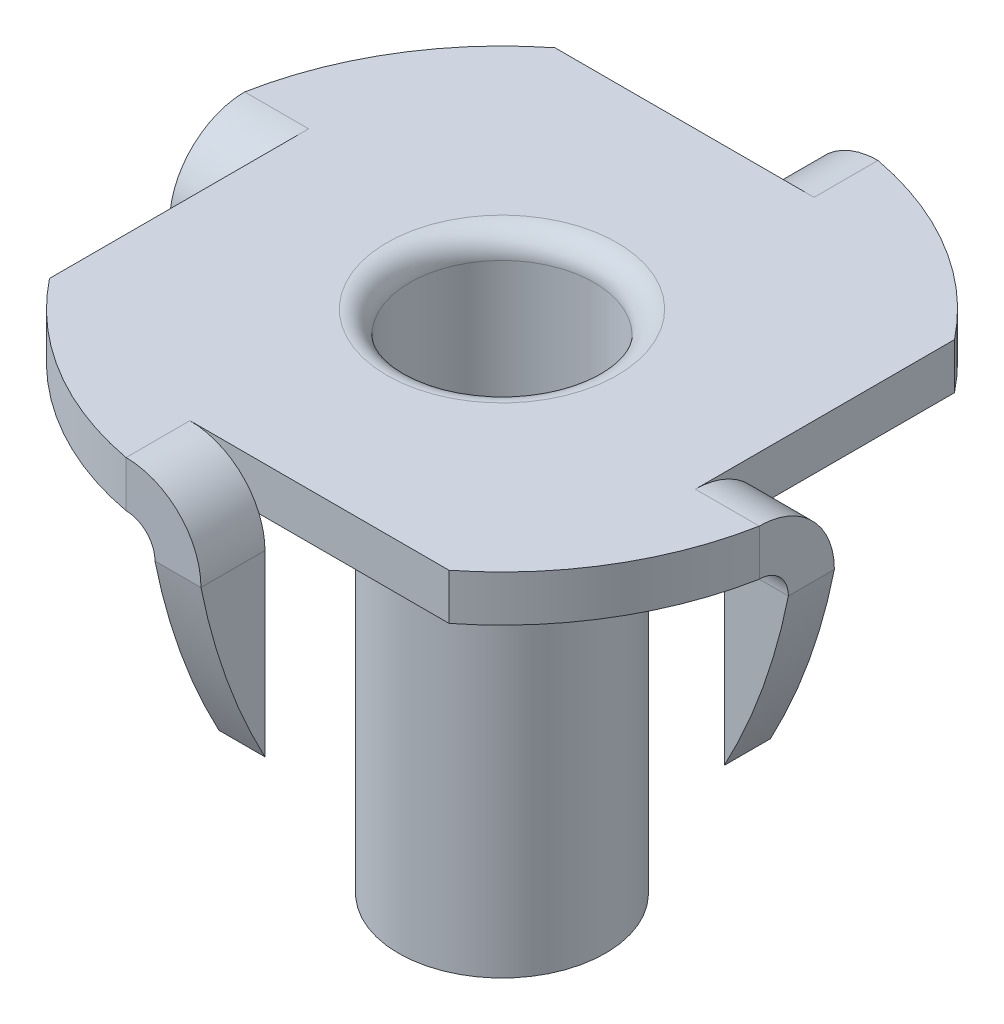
ISO-10303-21;
HEADER;
FILE_DESCRIPTION(('STEP AP214'),'2;1');
FILE_NAME('part.step','',(''),(''),'','','');
FILE_SCHEMA(('AUTOMOTIVE_DESIGN { 1 0 10303 214 1 1 1 1 }'));
ENDSEC;
DATA;
#1=APPLICATION_CONTEXT('core data for automotive mechanical design processes');
#2=APPLICATION_PROTOCOL_DEFINITION('international standard','automotive_design',2000,#1);
#3=PRODUCT_CONTEXT('',#1,'mechanical');
#4=PRODUCT('Part','Part','',(#3));
#5=PRODUCT_RELATED_PRODUCT_CATEGORY('part','',(#4));
#6=PRODUCT_DEFINITION_FORMATION('','',#4);
#7=PRODUCT_DEFINITION_CONTEXT('part definition',#1,'design');
#8=PRODUCT_DEFINITION('design','',#6,#7);
#9=PRODUCT_DEFINITION_SHAPE('','',#8);
#10=(LENGTH_UNIT() NAMED_UNIT(*) SI_UNIT(.MILLI.,.METRE.));
#11=(NAMED_UNIT(*) PLANE_ANGLE_UNIT() SI_UNIT($,.RADIAN.));
#12=(NAMED_UNIT(*) SI_UNIT($,.STERADIAN.) SOLID_ANGLE_UNIT());
#13=UNCERTAINTY_MEASURE_WITH_UNIT(LENGTH_MEASURE(1.E-05),#10,'distance_accuracy_value','');
#14=(GEOMETRIC_REPRESENTATION_CONTEXT(3) GLOBAL_UNCERTAINTY_ASSIGNED_CONTEXT((#13)) GLOBAL_UNIT_ASSIGNED_CONTEXT((#10,
#11,#12)) REPRESENTATION_CONTEXT('',''));
#15=CARTESIAN_POINT('',(0.,0.,0.));
#16=DIRECTION('',(0.,0.,1.));
#17=DIRECTION('',(1.,0.,0.));
#18=AXIS2_PLACEMENT_3D('',#15,#16,#17);
#19=CARTESIAN_POINT('',(8.71808458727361,0.,12.5509212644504));
#20=DIRECTION('',(-1.,0.,0.));
#21=DIRECTION('',(0.,1.,0.));
#22=AXIS2_PLACEMENT_3D('',#19,#20,#21);
#23=PLANE('',#22);
#24=DIRECTION('',(0.,1.,0.));
#25=VECTOR('',#24,1.);
#26=CARTESIAN_POINT('',(8.71808458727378,0.,1.04673390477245));
#27=LINE('',#26,#25);
#28=CARTESIAN_POINT('',(8.71808458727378,-7.1628,1.04673390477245));
#29=VERTEX_POINT('',#28);
#30=CARTESIAN_POINT('',(8.71808458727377,-1.,1.04673390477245));
#31=VERTEX_POINT('',#30);
#32=EDGE_CURVE('E752',#29,#31,#27,.T.);
#33=ORIENTED_EDGE('',*,*,#32,.T.);
#34=DIRECTION('',(0.,0.,-1.));
#35=VECTOR('',#34,1.);
#36=CARTESIAN_POINT('',(8.71808458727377,-1.,1.04673390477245));
#37=LINE('',#36,#35);
#38=CARTESIAN_POINT('',(8.7180845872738,-1.,-0.54076609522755));
#39=VERTEX_POINT('',#38);
#40=EDGE_CURVE('E238',#31,#39,#37,.T.);
#41=ORIENTED_EDGE('',*,*,#40,.T.);
#42=DIRECTION('',(0.,1.,0.));
#43=VECTOR('',#42,1.);
#44=CARTESIAN_POINT('',(8.7180845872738,0.,-0.54076609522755));
#45=LINE('',#44,#43);
#46=CARTESIAN_POINT('',(8.7180845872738,-7.1628,-0.54076609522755));
#47=VERTEX_POINT('',#46);
#48=EDGE_CURVE('E753',#47,#39,#45,.T.);
#49=ORIENTED_EDGE('',*,*,#48,.F.);
#50=DIRECTION('',(0.,0.,-1.));
#51=VECTOR('',#50,1.);
#52=CARTESIAN_POINT('',(8.71808458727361,-7.1628,12.5509212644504));
#53=LINE('',#52,#51);
#54=EDGE_CURVE('E56',#29,#47,#53,.T.);
#55=ORIENTED_EDGE('',*,*,#54,.F.);
#56=EDGE_LOOP('',(#33,#41,#49,#55));
#57=FACE_BOUND('',#56,.T.);
#58=ADVANCED_FACE('F37',(#57),#23,.T.);
#59=CARTESIAN_POINT('',(-10.8750680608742,3.32810054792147,12.5509212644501));
#60=DIRECTION('',(0.,0.,-1.));
#61=DIRECTION('',(0.,1.,0.));
#62=AXIS2_PLACEMENT_3D('',#59,#60,#61);
#63=CYLINDRICAL_SURFACE('',#62,22.225);
#64=CARTESIAN_POINT('',(-10.875068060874,3.32810054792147,-0.540766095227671));
#65=DIRECTION('',(0.,0.,1.));
#66=DIRECTION('',(1.,0.,0.));
#67=AXIS2_PLACEMENT_3D('',#64,#65,#66);
#68=CIRCLE('',#67,22.225);
#69=CARTESIAN_POINT('',(10.9244312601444,-0.999999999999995,-0.540766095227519));
#70=VERTEX_POINT('',#69);
#71=EDGE_CURVE('E740',#70,#47,#68,.F.);
#72=ORIENTED_EDGE('',*,*,#71,.F.);
#73=CARTESIAN_POINT('',(10.9244312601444,-0.999999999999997,1.04673390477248));
#74=CARTESIAN_POINT('',(10.9244312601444,-0.999999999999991,-0.540766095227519));
#75=B_SPLINE_CURVE_WITH_KNOTS('',1,(#73,#74),.UNSPECIFIED.,.F.,.F.,(2,2),(0.,1.),.UNSPECIFIED.);
#76=CARTESIAN_POINT('',(10.9244312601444,-0.999999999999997,1.04673390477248));
#77=VERTEX_POINT('',#76);
#78=EDGE_CURVE('E757',#77,#70,#75,.T.);
#79=ORIENTED_EDGE('',*,*,#78,.F.);
#80=CARTESIAN_POINT('',(-10.875068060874,3.32810054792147,1.04673390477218));
#81=DIRECTION('',(0.,0.,-1.));
#82=DIRECTION('',(0.,1.,0.));
#83=AXIS2_PLACEMENT_3D('',#80,#81,#82);
#84=CIRCLE('',#83,22.225);
#85=EDGE_CURVE('E52',#29,#77,#84,.F.);
#86=ORIENTED_EDGE('',*,*,#85,.F.);
#87=ORIENTED_EDGE('',*,*,#54,.T.);
#88=EDGE_LOOP('',(#72,#79,#86,#87));
#89=FACE_BOUND('',#88,.T.);
#90=ADVANCED_FACE('F725',(#89),#63,.T.);
#91=CARTESIAN_POINT('',(-10.875068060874,3.32810054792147,1.04673390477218));
#92=DIRECTION('',(0.,0.,-1.));
#93=DIRECTION('',(-1.,0.,0.));
#94=AXIS2_PLACEMENT_3D('',#91,#92,#93);
#95=PLANE('',#94);
#96=ORIENTED_EDGE('',*,*,#85,.T.);
#97=DIRECTION('',(1.,0.,0.));
#98=VECTOR('',#97,1.);
#99=CARTESIAN_POINT('',(8.71808458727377,-1.,1.04673390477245));
#100=LINE('',#99,#98);
#101=EDGE_CURVE('E242',#31,#77,#100,.T.);
#102=ORIENTED_EDGE('',*,*,#101,.F.);
#103=ORIENTED_EDGE('',*,*,#32,.F.);
#104=EDGE_LOOP('',(#96,#102,#103));
#105=FACE_BOUND('',#104,.T.);
#106=ADVANCED_FACE('F721',(#105),#95,.F.);
#107=CARTESIAN_POINT('',(11.0993345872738,0.,-0.540766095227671));
#108=DIRECTION('',(0.,0.,1.));
#109=DIRECTION('',(1.,0.,0.));
#110=AXIS2_PLACEMENT_3D('',#107,#108,#109);
#111=PLANE('',#110);
#112=ORIENTED_EDGE('',*,*,#48,.T.);
#113=DIRECTION('',(1.,0.,0.));
#114=VECTOR('',#113,1.);
#115=CARTESIAN_POINT('',(8.71808458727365,-1.,-0.540766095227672));
#116=LINE('',#115,#114);
#117=EDGE_CURVE('E750',#39,#70,#116,.T.);
#118=ORIENTED_EDGE('',*,*,#117,.T.);
#119=ORIENTED_EDGE('',*,*,#71,.T.);
#120=EDGE_LOOP('',(#112,#118,#119));
#121=FACE_BOUND('',#120,.T.);
#122=ADVANCED_FACE('F718',(#121),#111,.F.);
#123=CARTESIAN_POINT('',(8.71808458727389,0.,-6.89076609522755));
#124=DIRECTION('',(-1.,0.,0.));
#125=DIRECTION('',(0.,0.,1.));
#126=AXIS2_PLACEMENT_3D('',#123,#124,#125);
#127=PLANE('',#126);
#128=CARTESIAN_POINT('',(8.71808458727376,-1.,2.04673390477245));
#129=DIRECTION('',(1.,0.,0.));
#130=DIRECTION('',(0.,0.,-1.));
#131=AXIS2_PLACEMENT_3D('',#128,#129,#130);
#132=CIRCLE('',#131,2.5875);
#133=CARTESIAN_POINT('',(8.71808458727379,0.,-0.33971874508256));
#134=VERTEX_POINT('',#133);
#135=CARTESIAN_POINT('',(8.71808458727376,1.5875,2.04673390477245));
#136=VERTEX_POINT('',#135);
#137=EDGE_CURVE('E226',#134,#136,#132,.T.);
#138=ORIENTED_EDGE('',*,*,#137,.F.);
#139=DIRECTION('',(0.,0.,1.));
#140=VECTOR('',#139,1.);
#141=CARTESIAN_POINT('',(8.7180845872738,0.,-0.770882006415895));
#142=LINE('',#141,#140);
#143=CARTESIAN_POINT('',(8.71808458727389,0.,-6.89076609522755));
#144=VERTEX_POINT('',#143);
#145=EDGE_CURVE('E635',#144,#134,#142,.T.);
#146=ORIENTED_EDGE('',*,*,#145,.F.);
#147=DIRECTION('',(0.,1.,0.));
#148=VECTOR('',#147,1.);
#149=CARTESIAN_POINT('',(8.71808458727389,0.,-6.89076609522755));
#150=LINE('',#149,#148);
#151=CARTESIAN_POINT('',(8.71808458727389,1.58750000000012,-6.89076609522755));
#152=VERTEX_POINT('',#151);
#153=EDGE_CURVE('E229',#144,#152,#150,.T.);
#154=ORIENTED_EDGE('',*,*,#153,.T.);
#155=DIRECTION('',(0.,0.,1.));
#156=VECTOR('',#155,1.);
#157=CARTESIAN_POINT('',(8.71808458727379,1.5875,-0.540766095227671));
#158=LINE('',#157,#156);
#159=EDGE_CURVE('E214',#152,#136,#158,.T.);
#160=ORIENTED_EDGE('',*,*,#159,.T.);
#161=EDGE_LOOP('',(#138,#146,#154,#160));
#162=FACE_BOUND('',#161,.T.);
#163=ADVANCED_FACE('F225',(#162),#127,.F.);
#164=CARTESIAN_POINT('',(12.5509212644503,0.,-8.71808458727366));
#165=DIRECTION('',(0.,0.,1.));
#166=DIRECTION('',(0.,1.,0.));
#167=AXIS2_PLACEMENT_3D('',#164,#165,#166);
#168=PLANE('',#167);
#169=DIRECTION('',(0.,1.,0.));
#170=VECTOR('',#169,1.);
#171=CARTESIAN_POINT('',(1.04673390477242,0.,-8.71808458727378));
#172=LINE('',#171,#170);
#173=CARTESIAN_POINT('',(1.04673390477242,-7.1628,-8.71808458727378));
#174=VERTEX_POINT('',#173);
#175=CARTESIAN_POINT('',(1.04673390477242,-1.,-8.71808458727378));
#176=VERTEX_POINT('',#175);
#177=EDGE_CURVE('E677',#174,#176,#172,.T.);
#178=ORIENTED_EDGE('',*,*,#177,.T.);
#179=DIRECTION('',(-1.,0.,0.));
#180=VECTOR('',#179,1.);
#181=CARTESIAN_POINT('',(1.04673390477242,-1.,-8.71808458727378));
#182=LINE('',#181,#180);
#183=CARTESIAN_POINT('',(-0.54076609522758,-1.,-8.7180845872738));
#184=VERTEX_POINT('',#183);
#185=EDGE_CURVE('E669',#176,#184,#182,.T.);
#186=ORIENTED_EDGE('',*,*,#185,.T.);
#187=DIRECTION('',(0.,1.,0.));
#188=VECTOR('',#187,1.);
#189=CARTESIAN_POINT('',(-0.54076609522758,0.,-8.7180845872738));
#190=LINE('',#189,#188);
#191=CARTESIAN_POINT('',(-0.54076609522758,-7.1628,-8.7180845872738));
#192=VERTEX_POINT('',#191);
#193=EDGE_CURVE('E673',#192,#184,#190,.T.);
#194=ORIENTED_EDGE('',*,*,#193,.F.);
#195=DIRECTION('',(-1.,0.,0.));
#196=VECTOR('',#195,1.);
#197=CARTESIAN_POINT('',(12.5509212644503,-7.1628,-8.71808458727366));
#198=LINE('',#197,#196);
#199=EDGE_CURVE('E679',#174,#192,#198,.T.);
#200=ORIENTED_EDGE('',*,*,#199,.F.);
#201=EDGE_LOOP('',(#178,#186,#194,#200));
#202=FACE_BOUND('',#201,.T.);
#203=ADVANCED_FACE('F713',(#202),#168,.T.);
#204=CARTESIAN_POINT('',(12.5509212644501,3.32810054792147,10.8750680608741));
#205=DIRECTION('',(-1.,0.,0.));
#206=DIRECTION('',(0.,-1.,0.));
#207=AXIS2_PLACEMENT_3D('',#204,#205,#206);
#208=CYLINDRICAL_SURFACE('',#207,22.225);
#209=CARTESIAN_POINT('',(-0.540766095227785,3.32810054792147,10.875068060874));
#210=DIRECTION('',(1.,0.,0.));
#211=DIRECTION('',(0.,1.,0.));
#212=AXIS2_PLACEMENT_3D('',#209,#210,#211);
#213=CIRCLE('',#212,22.225);
#214=CARTESIAN_POINT('',(-0.540766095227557,-0.999999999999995,-10.9244312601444));
#215=VERTEX_POINT('',#214);
#216=EDGE_CURVE('E239',#215,#192,#213,.F.);
#217=ORIENTED_EDGE('',*,*,#216,.F.);
#218=CARTESIAN_POINT('',(1.04673390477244,-0.999999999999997,-10.9244312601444));
#219=CARTESIAN_POINT('',(-0.540766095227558,-0.999999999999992,-10.9244312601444));
#220=B_SPLINE_CURVE_WITH_KNOTS('',1,(#218,#219),.UNSPECIFIED.,.F.,.F.,(2,2),(0.,1.),.UNSPECIFIED.);
#221=CARTESIAN_POINT('',(1.04673390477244,-0.999999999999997,-10.9244312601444));
#222=VERTEX_POINT('',#221);
#223=EDGE_CURVE('E676',#222,#215,#220,.T.);
#224=ORIENTED_EDGE('',*,*,#223,.F.);
#225=CARTESIAN_POINT('',(1.04673390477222,3.32810054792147,10.875068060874));
#226=DIRECTION('',(-1.,0.,0.));
#227=DIRECTION('',(0.,-1.,0.));
#228=AXIS2_PLACEMENT_3D('',#225,#226,#227);
#229=CIRCLE('',#228,22.225);
#230=EDGE_CURVE('E245',#174,#222,#229,.F.);
#231=ORIENTED_EDGE('',*,*,#230,.F.);
#232=ORIENTED_EDGE('',*,*,#199,.T.);
#233=EDGE_LOOP('',(#217,#224,#231,#232));
#234=FACE_BOUND('',#233,.T.);
#235=ADVANCED_FACE('F702',(#234),#208,.T.);
#236=CARTESIAN_POINT('',(1.04673390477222,3.32810054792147,10.875068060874));
#237=DIRECTION('',(-1.,0.,0.));
#238=DIRECTION('',(0.,0.,1.));
#239=AXIS2_PLACEMENT_3D('',#236,#237,#238);
#240=PLANE('',#239);
#241=ORIENTED_EDGE('',*,*,#230,.T.);
#242=DIRECTION('',(0.,0.,-1.));
#243=VECTOR('',#242,1.);
#244=CARTESIAN_POINT('',(1.04673390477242,-1.,-8.71808458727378));
#245=LINE('',#244,#243);
#246=EDGE_CURVE('E672',#176,#222,#245,.T.);
#247=ORIENTED_EDGE('',*,*,#246,.F.);
#248=ORIENTED_EDGE('',*,*,#177,.F.);
#249=EDGE_LOOP('',(#241,#247,#248));
#250=FACE_BOUND('',#249,.T.);
#251=ADVANCED_FACE('F712',(#250),#240,.F.);
#252=CARTESIAN_POINT('',(-0.540766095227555,0.,-11.0993345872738));
#253=DIRECTION('',(1.,0.,0.));
#254=DIRECTION('',(0.,0.,-1.));
#255=AXIS2_PLACEMENT_3D('',#252,#253,#254);
#256=PLANE('',#255);
#257=ORIENTED_EDGE('',*,*,#193,.T.);
#258=DIRECTION('',(0.,0.,-1.));
#259=VECTOR('',#258,1.);
#260=CARTESIAN_POINT('',(-0.54076609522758,-1.,-8.71808458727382));
#261=LINE('',#260,#259);
#262=EDGE_CURVE('E675',#184,#215,#261,.T.);
#263=ORIENTED_EDGE('',*,*,#262,.T.);
#264=ORIENTED_EDGE('',*,*,#216,.T.);
#265=EDGE_LOOP('',(#257,#263,#264));
#266=FACE_BOUND('',#265,.T.);
#267=ADVANCED_FACE('F881',(#266),#256,.F.);
#268=CARTESIAN_POINT('',(-6.89076609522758,0.,-8.71808458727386));
#269=DIRECTION('',(0.,0.,1.));
#270=DIRECTION('',(1.,0.,0.));
#271=AXIS2_PLACEMENT_3D('',#268,#269,#270);
#272=PLANE('',#271);
#273=CARTESIAN_POINT('',(2.04673390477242,-1.,-8.71808458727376));
#274=DIRECTION('',(0.,0.,-1.));
#275=DIRECTION('',(-1.,0.,0.));
#276=AXIS2_PLACEMENT_3D('',#273,#274,#275);
#277=CIRCLE('',#276,2.5875);
#278=CARTESIAN_POINT('',(-0.339718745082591,0.,-8.71808458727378));
#279=VERTEX_POINT('',#278);
#280=CARTESIAN_POINT('',(2.04673390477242,1.5875,-8.71808458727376));
#281=VERTEX_POINT('',#280);
#282=EDGE_CURVE('E351',#279,#281,#277,.T.);
#283=ORIENTED_EDGE('',*,*,#282,.F.);
#284=DIRECTION('',(1.,0.,0.));
#285=VECTOR('',#284,1.);
#286=CARTESIAN_POINT('',(-0.770882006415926,0.,-8.7180845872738));
#287=LINE('',#286,#285);
#288=CARTESIAN_POINT('',(-6.89076609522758,0.,-8.71808458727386));
#289=VERTEX_POINT('',#288);
#290=EDGE_CURVE('E638',#289,#279,#287,.T.);
#291=ORIENTED_EDGE('',*,*,#290,.F.);
#292=DIRECTION('',(0.,1.,0.));
#293=VECTOR('',#292,1.);
#294=CARTESIAN_POINT('',(-6.89076609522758,0.,-8.71808458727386));
#295=LINE('',#294,#293);
#296=CARTESIAN_POINT('',(-6.89076609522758,1.5875,-8.71808458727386));
#297=VERTEX_POINT('',#296);
#298=EDGE_CURVE('E434',#289,#297,#295,.T.);
#299=ORIENTED_EDGE('',*,*,#298,.T.);
#300=DIRECTION('',(1.,0.,0.));
#301=VECTOR('',#300,1.);
#302=CARTESIAN_POINT('',(-0.54076609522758,1.5875,-8.7180845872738));
#303=LINE('',#302,#301);
#304=EDGE_CURVE('E645',#297,#281,#303,.T.);
#305=ORIENTED_EDGE('',*,*,#304,.T.);
#306=EDGE_LOOP('',(#283,#291,#299,#305));
#307=FACE_BOUND('',#306,.T.);
#308=ADVANCED_FACE('F407',(#307),#272,.F.);
#309=CARTESIAN_POINT('',(-8.7180845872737,0.,-12.5509212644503));
#310=DIRECTION('',(1.,0.,0.));
#311=DIRECTION('',(0.,1.,0.));
#312=AXIS2_PLACEMENT_3D('',#309,#310,#311);
#313=PLANE('',#312);
#314=DIRECTION('',(0.,1.,0.));
#315=VECTOR('',#314,1.);
#316=CARTESIAN_POINT('',(-8.71808458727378,0.,-1.04673390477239));
#317=LINE('',#316,#315);
#318=CARTESIAN_POINT('',(-8.71808458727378,-7.1628,-1.04673390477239));
#319=VERTEX_POINT('',#318);
#320=CARTESIAN_POINT('',(-8.71808458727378,-1.,-1.04673390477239));
#321=VERTEX_POINT('',#320);
#322=EDGE_CURVE('E981',#319,#321,#317,.T.);
#323=ORIENTED_EDGE('',*,*,#322,.T.);
#324=DIRECTION('',(0.,0.,1.));
#325=VECTOR('',#324,1.);
#326=CARTESIAN_POINT('',(-8.71808458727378,-1.,-1.04673390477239));
#327=LINE('',#326,#325);
#328=CARTESIAN_POINT('',(-8.7180845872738,-1.,0.54076609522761));
#329=VERTEX_POINT('',#328);
#330=EDGE_CURVE('E859',#321,#329,#327,.T.);
#331=ORIENTED_EDGE('',*,*,#330,.T.);
#332=DIRECTION('',(0.,1.,0.));
#333=VECTOR('',#332,1.);
#334=CARTESIAN_POINT('',(-8.7180845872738,0.,0.54076609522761));
#335=LINE('',#334,#333);
#336=CARTESIAN_POINT('',(-8.71808458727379,-7.1628,0.54076609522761));
#337=VERTEX_POINT('',#336);
#338=EDGE_CURVE('E973',#337,#329,#335,.T.);
#339=ORIENTED_EDGE('',*,*,#338,.F.);
#340=DIRECTION('',(0.,0.,1.));
#341=VECTOR('',#340,1.);
#342=CARTESIAN_POINT('',(-8.7180845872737,-7.1628,-12.5509212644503));
#343=LINE('',#342,#341);
#344=EDGE_CURVE('E852',#319,#337,#343,.T.);
#345=ORIENTED_EDGE('',*,*,#344,.F.);
#346=EDGE_LOOP('',(#323,#331,#339,#345));
#347=FACE_BOUND('',#346,.T.);
#348=ADVANCED_FACE('F876',(#347),#313,.T.);
#349=CARTESIAN_POINT('',(10.8750680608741,3.32810054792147,-12.5509212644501));
#350=DIRECTION('',(0.,0.,1.));
#351=DIRECTION('',(0.,-1.,0.));
#352=AXIS2_PLACEMENT_3D('',#349,#350,#351);
#353=CYLINDRICAL_SURFACE('',#352,22.225);
#354=CARTESIAN_POINT('',(10.875068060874,3.32810054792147,0.540766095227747));
#355=DIRECTION('',(0.,0.,-1.));
#356=DIRECTION('',(0.,1.,0.));
#357=AXIS2_PLACEMENT_3D('',#354,#355,#356);
#358=CIRCLE('',#357,22.225);
#359=CARTESIAN_POINT('',(-10.9244312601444,-0.999999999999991,0.540766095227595));
#360=VERTEX_POINT('',#359);
#361=EDGE_CURVE('E851',#360,#337,#358,.F.);
#362=ORIENTED_EDGE('',*,*,#361,.F.);
#363=CARTESIAN_POINT('',(-10.9244312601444,-0.999999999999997,-1.0467339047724));
#364=CARTESIAN_POINT('',(-10.9244312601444,-0.999999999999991,0.540766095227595));
#365=B_SPLINE_CURVE_WITH_KNOTS('',1,(#363,#364),.UNSPECIFIED.,.F.,.F.,(2,2),(0.,1.),.UNSPECIFIED.);
#366=CARTESIAN_POINT('',(-10.9244312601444,-1.,-1.04673390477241));
#367=VERTEX_POINT('',#366);
#368=EDGE_CURVE('E858',#367,#360,#365,.T.);
#369=ORIENTED_EDGE('',*,*,#368,.F.);
#370=CARTESIAN_POINT('',(10.875068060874,3.32810054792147,-1.04673390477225));
#371=DIRECTION('',(0.,0.,1.));
#372=DIRECTION('',(0.,-1.,0.));
#373=AXIS2_PLACEMENT_3D('',#370,#371,#372);
#374=CIRCLE('',#373,22.225);
#375=EDGE_CURVE('E848',#319,#367,#374,.F.);
#376=ORIENTED_EDGE('',*,*,#375,.F.);
#377=ORIENTED_EDGE('',*,*,#344,.T.);
#378=EDGE_LOOP('',(#362,#369,#376,#377));
#379=FACE_BOUND('',#378,.T.);
#380=ADVANCED_FACE('F865',(#379),#353,.T.);
#381=CARTESIAN_POINT('',(10.875068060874,3.32810054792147,-1.04673390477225));
#382=DIRECTION('',(0.,0.,1.));
#383=DIRECTION('',(1.,0.,0.));
#384=AXIS2_PLACEMENT_3D('',#381,#382,#383);
#385=PLANE('',#384);
#386=ORIENTED_EDGE('',*,*,#375,.T.);
#387=DIRECTION('',(-1.,0.,0.));
#388=VECTOR('',#387,1.);
#389=CARTESIAN_POINT('',(-8.71808458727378,-1.,-1.04673390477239));
#390=LINE('',#389,#388);
#391=EDGE_CURVE('E855',#321,#367,#390,.T.);
#392=ORIENTED_EDGE('',*,*,#391,.F.);
#393=ORIENTED_EDGE('',*,*,#322,.F.);
#394=EDGE_LOOP('',(#386,#392,#393));
#395=FACE_BOUND('',#394,.T.);
#396=ADVANCED_FACE('F875',(#395),#385,.F.);
#397=CARTESIAN_POINT('',(-11.0993345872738,0.,0.540766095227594));
#398=DIRECTION('',(0.,0.,-1.));
#399=DIRECTION('',(-1.,0.,0.));
#400=AXIS2_PLACEMENT_3D('',#397,#398,#399);
#401=PLANE('',#400);
#402=ORIENTED_EDGE('',*,*,#338,.T.);
#403=DIRECTION('',(-1.,0.,0.));
#404=VECTOR('',#403,1.);
#405=CARTESIAN_POINT('',(-8.71808458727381,-1.,0.540766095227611));
#406=LINE('',#405,#404);
#407=EDGE_CURVE('E976',#329,#360,#406,.T.);
#408=ORIENTED_EDGE('',*,*,#407,.T.);
#409=ORIENTED_EDGE('',*,*,#361,.T.);
#410=EDGE_LOOP('',(#402,#408,#409));
#411=FACE_BOUND('',#410,.T.);
#412=ADVANCED_FACE('F961',(#411),#401,.F.);
#413=CARTESIAN_POINT('',(-8.71808458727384,0.,6.89076609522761));
#414=DIRECTION('',(1.,0.,0.));
#415=DIRECTION('',(0.,0.,-1.));
#416=AXIS2_PLACEMENT_3D('',#413,#414,#415);
#417=PLANE('',#416);
#418=CARTESIAN_POINT('',(-8.71808458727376,-1.,-2.04673390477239));
#419=DIRECTION('',(-1.,0.,0.));
#420=DIRECTION('',(0.,0.,1.));
#421=AXIS2_PLACEMENT_3D('',#418,#419,#420);
#422=CIRCLE('',#421,2.5875);
#423=CARTESIAN_POINT('',(-8.71808458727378,0.,0.33971874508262));
#424=VERTEX_POINT('',#423);
#425=CARTESIAN_POINT('',(-8.71808458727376,1.5875,-2.04673390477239));
#426=VERTEX_POINT('',#425);
#427=EDGE_CURVE('E447',#424,#426,#422,.T.);
#428=ORIENTED_EDGE('',*,*,#427,.F.);
#429=DIRECTION('',(0.,0.,-1.));
#430=VECTOR('',#429,1.);
#431=CARTESIAN_POINT('',(-8.7180845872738,0.,0.770882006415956));
#432=LINE('',#431,#430);
#433=CARTESIAN_POINT('',(-8.71808458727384,0.,6.89076609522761));
#434=VERTEX_POINT('',#433);
#435=EDGE_CURVE('E642',#434,#424,#432,.T.);
#436=ORIENTED_EDGE('',*,*,#435,.F.);
#437=DIRECTION('',(0.,1.,0.));
#438=VECTOR('',#437,1.);
#439=CARTESIAN_POINT('',(-8.71808458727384,0.,6.89076609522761));
#440=LINE('',#439,#438);
#441=CARTESIAN_POINT('',(-8.71808458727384,1.5875,6.89076609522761));
#442=VERTEX_POINT('',#441);
#443=EDGE_CURVE('E530',#434,#442,#440,.T.);
#444=ORIENTED_EDGE('',*,*,#443,.T.);
#445=DIRECTION('',(0.,0.,-1.));
#446=VECTOR('',#445,1.);
#447=CARTESIAN_POINT('',(-8.71808458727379,1.5875,0.54076609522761));
#448=LINE('',#447,#446);
#449=EDGE_CURVE('E651',#442,#426,#448,.T.);
#450=ORIENTED_EDGE('',*,*,#449,.T.);
#451=EDGE_LOOP('',(#428,#436,#444,#450));
#452=FACE_BOUND('',#451,.T.);
#453=ADVANCED_FACE('F503',(#452),#417,.F.);
#454=CARTESIAN_POINT('',(-12.5509212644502,0.,8.71808458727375));
#455=DIRECTION('',(0.,0.,-1.));
#456=DIRECTION('',(0.,1.,0.));
#457=AXIS2_PLACEMENT_3D('',#454,#455,#456);
#458=PLANE('',#457);
#459=DIRECTION('',(0.,1.,0.));
#460=VECTOR('',#459,1.);
#461=CARTESIAN_POINT('',(-1.04673390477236,0.,8.71808458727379));
#462=LINE('',#461,#460);
#463=CARTESIAN_POINT('',(-1.04673390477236,-7.1628,8.71808458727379));
#464=VERTEX_POINT('',#463);
#465=CARTESIAN_POINT('',(-1.04673390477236,-1.,8.71808458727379));
#466=VERTEX_POINT('',#465);
#467=EDGE_CURVE('E1010',#464,#466,#462,.T.);
#468=ORIENTED_EDGE('',*,*,#467,.T.);
#469=DIRECTION('',(1.,0.,0.));
#470=VECTOR('',#469,1.);
#471=CARTESIAN_POINT('',(-1.04673390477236,-1.,8.71808458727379));
#472=LINE('',#471,#470);
#473=CARTESIAN_POINT('',(0.540766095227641,-1.,8.71808458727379));
#474=VERTEX_POINT('',#473);
#475=EDGE_CURVE('E941',#466,#474,#472,.T.);
#476=ORIENTED_EDGE('',*,*,#475,.T.);
#477=DIRECTION('',(0.,1.,0.));
#478=VECTOR('',#477,1.);
#479=CARTESIAN_POINT('',(0.540766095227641,-0.769884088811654,8.71808458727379));
#480=LINE('',#479,#478);
#481=CARTESIAN_POINT('',(0.540766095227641,-7.1628,8.71808458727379));
#482=VERTEX_POINT('',#481);
#483=EDGE_CURVE('E996',#482,#474,#480,.T.);
#484=ORIENTED_EDGE('',*,*,#483,.F.);
#485=DIRECTION('',(1.,0.,0.));
#486=VECTOR('',#485,1.);
#487=CARTESIAN_POINT('',(-12.5509212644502,-7.1628,8.71808458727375));
#488=LINE('',#487,#486);
#489=EDGE_CURVE('E934',#464,#482,#488,.T.);
#490=ORIENTED_EDGE('',*,*,#489,.F.);
#491=EDGE_LOOP('',(#468,#476,#484,#490));
#492=FACE_BOUND('',#491,.T.);
#493=ADVANCED_FACE('F957',(#492),#458,.T.);
#494=CARTESIAN_POINT('',(-12.5509212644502,3.32810054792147,-10.8750680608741));
#495=DIRECTION('',(1.,0.,0.));
#496=DIRECTION('',(0.,1.,0.));
#497=AXIS2_PLACEMENT_3D('',#494,#495,#496);
#498=CYLINDRICAL_SURFACE('',#497,22.225);
#499=CARTESIAN_POINT('',(0.540766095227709,3.32810054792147,-10.875068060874));
#500=DIRECTION('',(-1.,0.,0.));
#501=DIRECTION('',(0.,-1.,0.));
#502=AXIS2_PLACEMENT_3D('',#499,#500,#501);
#503=CIRCLE('',#502,22.225);
#504=CARTESIAN_POINT('',(0.540766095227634,-0.999999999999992,10.9244312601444));
#505=VERTEX_POINT('',#504);
#506=EDGE_CURVE('E933',#505,#482,#503,.F.);
#507=ORIENTED_EDGE('',*,*,#506,.F.);
#508=CARTESIAN_POINT('',(-1.04673390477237,-0.999999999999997,10.9244312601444));
#509=CARTESIAN_POINT('',(0.540766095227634,-0.999999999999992,10.9244312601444));
#510=B_SPLINE_CURVE_WITH_KNOTS('',1,(#508,#509),.UNSPECIFIED.,.F.,.F.,(2,2),(0.,1.),.UNSPECIFIED.);
#511=CARTESIAN_POINT('',(-1.04673390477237,-1.,10.9244312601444));
#512=VERTEX_POINT('',#511);
#513=EDGE_CURVE('E940',#512,#505,#510,.T.);
#514=ORIENTED_EDGE('',*,*,#513,.F.);
#515=CARTESIAN_POINT('',(-1.04673390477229,3.32810054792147,-10.875068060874));
#516=DIRECTION('',(1.,0.,0.));
#517=DIRECTION('',(0.,1.,0.));
#518=AXIS2_PLACEMENT_3D('',#515,#516,#517);
#519=CIRCLE('',#518,22.225);
#520=EDGE_CURVE('E930',#464,#512,#519,.F.);
#521=ORIENTED_EDGE('',*,*,#520,.F.);
#522=ORIENTED_EDGE('',*,*,#489,.T.);
#523=EDGE_LOOP('',(#507,#514,#521,#522));
#524=FACE_BOUND('',#523,.T.);
#525=ADVANCED_FACE('F947',(#524),#498,.T.);
#526=CARTESIAN_POINT('',(-1.04673390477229,3.32810054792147,-10.875068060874));
#527=DIRECTION('',(1.,0.,0.));
#528=DIRECTION('',(0.,0.,-1.));
#529=AXIS2_PLACEMENT_3D('',#526,#527,#528);
#530=PLANE('',#529);
#531=ORIENTED_EDGE('',*,*,#520,.T.);
#532=DIRECTION('',(0.,0.,1.));
#533=VECTOR('',#532,1.);
#534=CARTESIAN_POINT('',(-1.04673390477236,-1.,8.71808458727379));
#535=LINE('',#534,#533);
#536=EDGE_CURVE('E937',#466,#512,#535,.T.);
#537=ORIENTED_EDGE('',*,*,#536,.F.);
#538=ORIENTED_EDGE('',*,*,#467,.F.);
#539=EDGE_LOOP('',(#531,#537,#538));
#540=FACE_BOUND('',#539,.T.);
#541=ADVANCED_FACE('F956',(#540),#530,.F.);
#542=CARTESIAN_POINT('',(0.540766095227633,0.,11.0993345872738));
#543=DIRECTION('',(-1.,0.,0.));
#544=DIRECTION('',(0.,0.,1.));
#545=AXIS2_PLACEMENT_3D('',#542,#543,#544);
#546=PLANE('',#545);
#547=ORIENTED_EDGE('',*,*,#506,.T.);
#548=ORIENTED_EDGE('',*,*,#483,.T.);
#549=DIRECTION('',(0.,0.,1.));
#550=VECTOR('',#549,1.);
#551=CARTESIAN_POINT('',(0.540766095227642,-1.,8.7180845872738));
#552=LINE('',#551,#550);
#553=EDGE_CURVE('E1009',#474,#505,#552,.T.);
#554=ORIENTED_EDGE('',*,*,#553,.T.);
#555=EDGE_LOOP('',(#547,#548,#554));
#556=FACE_BOUND('',#555,.T.);
#557=ADVANCED_FACE('F784',(#556),#546,.F.);
#558=CARTESIAN_POINT('',(6.89076609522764,0.,8.71808458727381));
#559=DIRECTION('',(0.,0.,-1.));
#560=DIRECTION('',(-1.,0.,0.));
#561=AXIS2_PLACEMENT_3D('',#558,#559,#560);
#562=PLANE('',#561);
#563=CARTESIAN_POINT('',(-2.04673390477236,-1.,8.71808458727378));
#564=DIRECTION('',(0.,0.,1.));
#565=DIRECTION('',(1.,0.,0.));
#566=AXIS2_PLACEMENT_3D('',#563,#564,#565);
#567=CIRCLE('',#566,2.5875);
#568=CARTESIAN_POINT('',(0.339718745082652,0.,8.71808458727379));
#569=VERTEX_POINT('',#568);
#570=CARTESIAN_POINT('',(-2.04673390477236,1.5875,8.71808458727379));
#571=VERTEX_POINT('',#570);
#572=EDGE_CURVE('E543',#569,#571,#567,.T.);
#573=ORIENTED_EDGE('',*,*,#572,.F.);
#574=DIRECTION('',(1.,0.,0.));
#575=VECTOR('',#574,1.);
#576=CARTESIAN_POINT('',(-1.04673390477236,0.,8.71808458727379));
#577=LINE('',#576,#575);
#578=CARTESIAN_POINT('',(6.89076609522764,0.,8.71808458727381));
#579=VERTEX_POINT('',#578);
#580=EDGE_CURVE('E904',#569,#579,#577,.T.);
#581=ORIENTED_EDGE('',*,*,#580,.T.);
#582=DIRECTION('',(0.,1.,0.));
#583=VECTOR('',#582,1.);
#584=CARTESIAN_POINT('',(6.89076609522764,0.,8.71808458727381));
#585=LINE('',#584,#583);
#586=CARTESIAN_POINT('',(6.89076609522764,1.5875,8.71808458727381));
#587=VERTEX_POINT('',#586);
#588=EDGE_CURVE('E626',#579,#587,#585,.T.);
#589=ORIENTED_EDGE('',*,*,#588,.T.);
#590=DIRECTION('',(-1.,0.,0.));
#591=VECTOR('',#590,1.);
#592=CARTESIAN_POINT('',(-1.04673390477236,1.5875,8.71808458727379));
#593=LINE('',#592,#591);
#594=EDGE_CURVE('E222',#587,#571,#593,.T.);
#595=ORIENTED_EDGE('',*,*,#594,.T.);
#596=EDGE_LOOP('',(#573,#581,#589,#595));
#597=FACE_BOUND('',#596,.T.);
#598=ADVANCED_FACE('F599',(#597),#562,.F.);
#599=CARTESIAN_POINT('',(0.,-60.1988510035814,0.));
#600=DIRECTION('',(0.,1.,0.));
#601=DIRECTION('',(0.,0.,1.));
#602=AXIS2_PLACEMENT_3D('',#599,#600,#601);
#603=CYLINDRICAL_SURFACE('',#602,11.1125);
#604=CARTESIAN_POINT('',(10.9223869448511,1.5875,2.04673390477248));
#605=CARTESIAN_POINT('',(10.9223869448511,0.,2.04673390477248));
#606=B_SPLINE_CURVE_WITH_KNOTS('',1,(#604,#605),.UNSPECIFIED.,.F.,.F.,(2,2),(0.,1.),.UNSPECIFIED.);
#607=CARTESIAN_POINT('',(10.9223869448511,0.,2.04673390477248));
#608=VERTEX_POINT('',#607);
#609=CARTESIAN_POINT('',(10.9223869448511,1.5875,2.04673390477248));
#610=VERTEX_POINT('',#609);
#611=EDGE_CURVE('E335',#608,#610,#606,.F.);
#612=ORIENTED_EDGE('',*,*,#611,.T.);
#613=CARTESIAN_POINT('',(0.,1.5875,0.));
#614=DIRECTION('',(0.,1.,0.));
#615=DIRECTION('',(0.,0.,1.));
#616=AXIS2_PLACEMENT_3D('',#613,#614,#615);
#617=CIRCLE('',#616,11.1125);
#618=EDGE_CURVE('E216',#587,#610,#617,.T.);
#619=ORIENTED_EDGE('',*,*,#618,.F.);
#620=ORIENTED_EDGE('',*,*,#588,.F.);
#621=CARTESIAN_POINT('',(0.,0.,0.));
#622=DIRECTION('',(0.,1.,0.));
#623=DIRECTION('',(0.,0.,1.));
#624=AXIS2_PLACEMENT_3D('',#621,#622,#623);
#625=CIRCLE('',#624,11.1125);
#626=EDGE_CURVE('E221',#579,#608,#625,.T.);
#627=ORIENTED_EDGE('',*,*,#626,.T.);
#628=EDGE_LOOP('',(#612,#619,#620,#627));
#629=FACE_BOUND('',#628,.T.);
#630=ADVANCED_FACE('F770',(#629),#603,.T.);
#631=CARTESIAN_POINT('',(-2.04673390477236,1.5875,10.9223869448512));
#632=CARTESIAN_POINT('',(-2.04673390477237,0.,10.9223869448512));
#633=B_SPLINE_CURVE_WITH_KNOTS('',1,(#631,#632),.UNSPECIFIED.,.F.,.F.,(2,2),(0.,1.),.UNSPECIFIED.);
#634=CARTESIAN_POINT('',(-2.04673390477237,0.,10.9223869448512));
#635=VERTEX_POINT('',#634);
#636=CARTESIAN_POINT('',(-2.04673390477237,1.5875,10.9223869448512));
#637=VERTEX_POINT('',#636);
#638=EDGE_CURVE('E622',#635,#637,#633,.F.);
#639=ORIENTED_EDGE('',*,*,#638,.T.);
#640=EDGE_CURVE('E655',#442,#637,#617,.T.);
#641=ORIENTED_EDGE('',*,*,#640,.F.);
#642=ORIENTED_EDGE('',*,*,#443,.F.);
#643=EDGE_CURVE('E833',#434,#635,#625,.T.);
#644=ORIENTED_EDGE('',*,*,#643,.T.);
#645=EDGE_LOOP('',(#639,#641,#642,#644));
#646=FACE_BOUND('',#645,.T.);
#647=ADVANCED_FACE('F780',(#646),#603,.T.);
#648=CARTESIAN_POINT('',(-10.9223869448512,1.5875,-2.0467339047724));
#649=CARTESIAN_POINT('',(-10.9223869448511,0.,-2.0467339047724));
#650=B_SPLINE_CURVE_WITH_KNOTS('',1,(#648,#649),.UNSPECIFIED.,.F.,.F.,(2,2),(0.,1.),.UNSPECIFIED.);
#651=CARTESIAN_POINT('',(-10.9223869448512,0.,-2.0467339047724));
#652=VERTEX_POINT('',#651);
#653=CARTESIAN_POINT('',(-10.9223869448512,1.5875,-2.0467339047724));
#654=VERTEX_POINT('',#653);
#655=EDGE_CURVE('E526',#652,#654,#650,.F.);
#656=ORIENTED_EDGE('',*,*,#655,.T.);
#657=EDGE_CURVE('E648',#297,#654,#617,.T.);
#658=ORIENTED_EDGE('',*,*,#657,.F.);
#659=ORIENTED_EDGE('',*,*,#298,.F.);
#660=EDGE_CURVE('E837',#289,#652,#625,.T.);
#661=ORIENTED_EDGE('',*,*,#660,.T.);
#662=EDGE_LOOP('',(#656,#658,#659,#661));
#663=FACE_BOUND('',#662,.T.);
#664=ADVANCED_FACE('F918',(#663),#603,.T.);
#665=CARTESIAN_POINT('',(2.04673390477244,1.5875,-10.9223869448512));
#666=CARTESIAN_POINT('',(2.04673390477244,0.,-10.9223869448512));
#667=B_SPLINE_CURVE_WITH_KNOTS('',1,(#665,#666),.UNSPECIFIED.,.F.,.F.,(2,2),(0.,1.),.UNSPECIFIED.);
#668=CARTESIAN_POINT('',(2.04673390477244,0.,-10.9223869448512));
#669=VERTEX_POINT('',#668);
#670=CARTESIAN_POINT('',(2.04673390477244,1.5875,-10.9223869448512));
#671=VERTEX_POINT('',#670);
#672=EDGE_CURVE('E430',#669,#671,#667,.F.);
#673=ORIENTED_EDGE('',*,*,#672,.T.);
#674=EDGE_CURVE('E231',#152,#671,#617,.T.);
#675=ORIENTED_EDGE('',*,*,#674,.F.);
#676=ORIENTED_EDGE('',*,*,#153,.F.);
#677=EDGE_CURVE('E839',#144,#669,#625,.T.);
#678=ORIENTED_EDGE('',*,*,#677,.T.);
#679=EDGE_LOOP('',(#673,#675,#676,#678));
#680=FACE_BOUND('',#679,.T.);
#681=ADVANCED_FACE('F782',(#680),#603,.T.);
#682=CARTESIAN_POINT('',(0.,0.,0.));
#683=DIRECTION('',(0.,1.,0.));
#684=DIRECTION('',(0.,0.,1.));
#685=AXIS2_PLACEMENT_3D('',#682,#683,#684);
#686=PLANE('',#685);
#687=CARTESIAN_POINT('',(0.,0.,0.));
#688=DIRECTION('',(0.,1.,0.));
#689=DIRECTION('',(0.,0.,1.));
#690=AXIS2_PLACEMENT_3D('',#687,#688,#689);
#691=CIRCLE('',#690,3.571875);
#692=CARTESIAN_POINT('',(0.,0.,3.571875));
#693=VERTEX_POINT('',#692);
#694=EDGE_CURVE('E1344',#693,#693,#691,.T.);
#695=ORIENTED_EDGE('',*,*,#694,.T.);
#696=EDGE_LOOP('',(#695));
#697=FACE_BOUND('',#696,.T.);
#698=ORIENTED_EDGE('',*,*,#145,.T.);
#699=CARTESIAN_POINT('',(8.71808458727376,0.,2.04673390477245));
#700=VERTEX_POINT('',#699);
#701=EDGE_CURVE('E634',#134,#700,#142,.T.);
#702=ORIENTED_EDGE('',*,*,#701,.T.);
#703=DIRECTION('',(1.,0.,0.));
#704=VECTOR('',#703,1.);
#705=CARTESIAN_POINT('',(8.71808458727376,0.,2.04673390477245));
#706=LINE('',#705,#704);
#707=EDGE_CURVE('E251',#700,#608,#706,.T.);
#708=ORIENTED_EDGE('',*,*,#707,.T.);
#709=ORIENTED_EDGE('',*,*,#626,.F.);
#710=ORIENTED_EDGE('',*,*,#580,.F.);
#711=CARTESIAN_POINT('',(-2.04673390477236,0.,8.71808458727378));
#712=VERTEX_POINT('',#711);
#713=EDGE_CURVE('E828',#712,#569,#577,.T.);
#714=ORIENTED_EDGE('',*,*,#713,.F.);
#715=DIRECTION('',(0.,0.,1.));
#716=VECTOR('',#715,1.);
#717=CARTESIAN_POINT('',(-2.04673390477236,0.,8.71808458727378));
#718=LINE('',#717,#716);
#719=EDGE_CURVE('E1012',#712,#635,#718,.T.);
#720=ORIENTED_EDGE('',*,*,#719,.T.);
#721=ORIENTED_EDGE('',*,*,#643,.F.);
#722=ORIENTED_EDGE('',*,*,#435,.T.);
#723=CARTESIAN_POINT('',(-8.71808458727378,0.,-2.04673390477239));
#724=VERTEX_POINT('',#723);
#725=EDGE_CURVE('E641',#424,#724,#432,.T.);
#726=ORIENTED_EDGE('',*,*,#725,.T.);
#727=DIRECTION('',(-1.,0.,0.));
#728=VECTOR('',#727,1.);
#729=CARTESIAN_POINT('',(-8.71808458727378,0.,-2.04673390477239));
#730=LINE('',#729,#728);
#731=EDGE_CURVE('E922',#724,#652,#730,.T.);
#732=ORIENTED_EDGE('',*,*,#731,.T.);
#733=ORIENTED_EDGE('',*,*,#660,.F.);
#734=ORIENTED_EDGE('',*,*,#290,.T.);
#735=CARTESIAN_POINT('',(2.04673390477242,0.,-8.71808458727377));
#736=VERTEX_POINT('',#735);
#737=EDGE_CURVE('E637',#279,#736,#287,.T.);
#738=ORIENTED_EDGE('',*,*,#737,.T.);
#739=DIRECTION('',(0.,0.,-1.));
#740=VECTOR('',#739,1.);
#741=CARTESIAN_POINT('',(2.04673390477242,0.,-8.71808458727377));
#742=LINE('',#741,#740);
#743=EDGE_CURVE('E844',#736,#669,#742,.T.);
#744=ORIENTED_EDGE('',*,*,#743,.T.);
#745=ORIENTED_EDGE('',*,*,#677,.F.);
#746=EDGE_LOOP('',(#698,#702,#708,#709,#710,#714,#720,#721,#722,#726,#732,#733,#734,#738,#744,#745));
#747=FACE_BOUND('',#746,.T.);
#748=ADVANCED_FACE('F783',(#697,#747),#686,.F.);
#749=CARTESIAN_POINT('',(0.,1.5875,0.));
#750=DIRECTION('',(0.,1.,0.));
#751=DIRECTION('',(0.,0.,1.));
#752=AXIS2_PLACEMENT_3D('',#749,#750,#751);
#753=PLANE('',#752);
#754=CARTESIAN_POINT('',(0.,1.5875,0.));
#755=DIRECTION('',(0.,1.,0.));
#756=DIRECTION('',(0.,0.,1.));
#757=AXIS2_PLACEMENT_3D('',#754,#755,#756);
#758=CIRCLE('',#757,3.96875);
#759=CARTESIAN_POINT('',(0.,1.5875,3.96875));
#760=VERTEX_POINT('',#759);
#761=EDGE_CURVE('E11',#760,#760,#758,.F.);
#762=ORIENTED_EDGE('',*,*,#761,.T.);
#763=EDGE_LOOP('',(#762));
#764=FACE_BOUND('',#763,.T.);
#765=DIRECTION('',(-1.,0.,0.));
#766=VECTOR('',#765,1.);
#767=CARTESIAN_POINT('',(8.71808458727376,1.5875,2.04673390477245));
#768=LINE('',#767,#766);
#769=EDGE_CURVE('E210',#610,#136,#768,.T.);
#770=ORIENTED_EDGE('',*,*,#769,.T.);
#771=ORIENTED_EDGE('',*,*,#159,.F.);
#772=ORIENTED_EDGE('',*,*,#674,.T.);
#773=DIRECTION('',(0.,0.,1.));
#774=VECTOR('',#773,1.);
#775=CARTESIAN_POINT('',(2.04673390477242,1.5875,-8.71808458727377));
#776=LINE('',#775,#774);
#777=EDGE_CURVE('E666',#671,#281,#776,.T.);
#778=ORIENTED_EDGE('',*,*,#777,.T.);
#779=ORIENTED_EDGE('',*,*,#304,.F.);
#780=ORIENTED_EDGE('',*,*,#657,.T.);
#781=DIRECTION('',(1.,0.,0.));
#782=VECTOR('',#781,1.);
#783=CARTESIAN_POINT('',(-8.71808458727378,1.5875,-2.04673390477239));
#784=LINE('',#783,#782);
#785=EDGE_CURVE('E809',#654,#426,#784,.T.);
#786=ORIENTED_EDGE('',*,*,#785,.T.);
#787=ORIENTED_EDGE('',*,*,#449,.F.);
#788=ORIENTED_EDGE('',*,*,#640,.T.);
#789=DIRECTION('',(0.,0.,-1.));
#790=VECTOR('',#789,1.);
#791=CARTESIAN_POINT('',(-2.04673390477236,1.5875,8.71808458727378));
#792=LINE('',#791,#790);
#793=EDGE_CURVE('E812',#637,#571,#792,.T.);
#794=ORIENTED_EDGE('',*,*,#793,.T.);
#795=ORIENTED_EDGE('',*,*,#594,.F.);
#796=ORIENTED_EDGE('',*,*,#618,.T.);
#797=EDGE_LOOP('',(#770,#771,#772,#778,#779,#780,#786,#787,#788,#794,#795,#796));
#798=FACE_BOUND('',#797,.T.);
#799=ADVANCED_FACE('F212',(#764,#798),#753,.T.);
#800=CARTESIAN_POINT('',(-2.04673390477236,1.5875,10.9223869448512));
#801=CARTESIAN_POINT('',(-1.70796987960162,1.5875,10.9225573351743));
#802=CARTESIAN_POINT('',(-1.36946125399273,1.52015430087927,10.9227276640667));
#803=CARTESIAN_POINT('',(-0.743619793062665,1.26092227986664,10.9230683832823));
#804=CARTESIAN_POINT('',(-0.456594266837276,1.06913795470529,10.92323874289));
#805=CARTESIAN_POINT('',(0.0224040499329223,0.590139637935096,10.9235794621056));
#806=CARTESIAN_POINT('',(0.214188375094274,0.303114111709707,10.9237498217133));
#807=CARTESIAN_POINT('',(0.473420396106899,-0.322727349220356,10.9240905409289));
#808=CARTESIAN_POINT('',(0.540766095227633,-0.661235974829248,10.9242608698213));
#809=CARTESIAN_POINT('',(0.540766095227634,-0.999999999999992,10.9244312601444));
#810=CARTESIAN_POINT('',(-2.04673390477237,0.,10.9223869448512));
#811=CARTESIAN_POINT('',(-1.91581061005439,0.,10.9225573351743));
#812=CARTESIAN_POINT('',(-1.78498602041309,-0.0260273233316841,10.9227276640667));
#813=CARTESIAN_POINT('',(-1.54311492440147,-0.126213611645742,10.9230683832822));
#814=CARTESIAN_POINT('',(-1.43218718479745,-0.200333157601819,10.92323874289));
#815=CARTESIAN_POINT('',(-1.24706706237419,-0.385453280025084,10.9235794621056));
#816=CARTESIAN_POINT('',(-1.17294751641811,-0.496381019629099,10.9237498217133));
#817=CARTESIAN_POINT('',(-1.07276122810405,-0.738252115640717,10.9240905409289));
#818=CARTESIAN_POINT('',(-1.04673390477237,-0.869076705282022,10.9242608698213));
#819=CARTESIAN_POINT('',(-1.04673390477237,-0.999999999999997,10.9244312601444));
#820=B_SPLINE_SURFACE_WITH_KNOTS('',1,3,((#800,#801,#802,#803,#804,#805,#806,#807,#808,#809),
(#810,#811,#812,#813,#814,#815,#816,#817,#818,#819)),.UNSPECIFIED.,.F.,.F.,.F.,(2,2),(4,2,2,2,
4),(0.,1.),(0.,0.25,0.5,0.75,1.),.UNSPECIFIED.);
#821=CARTESIAN_POINT('',(-2.04673390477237,0.,10.9223869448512));
#822=CARTESIAN_POINT('',(-1.91581061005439,0.,10.9225573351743));
#823=CARTESIAN_POINT('',(-1.78498602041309,-0.0260273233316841,10.9227276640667));
#824=CARTESIAN_POINT('',(-1.54311492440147,-0.126213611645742,10.9230683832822));
#825=CARTESIAN_POINT('',(-1.43218718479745,-0.200333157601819,10.92323874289));
#826=CARTESIAN_POINT('',(-1.24706706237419,-0.385453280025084,10.9235794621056));
#827=CARTESIAN_POINT('',(-1.17294751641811,-0.496381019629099,10.9237498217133));
#828=CARTESIAN_POINT('',(-1.07276122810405,-0.738252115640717,10.9240905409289));
#829=CARTESIAN_POINT('',(-1.04673390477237,-0.869076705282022,10.9242608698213));
#830=CARTESIAN_POINT('',(-1.04673390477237,-0.999999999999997,10.9244312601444));
#831=B_SPLINE_CURVE_WITH_KNOTS('',3,(#821,#822,#823,#824,#825,#826,#827,#828,#829,#830),
.UNSPECIFIED.,.F.,.F.,(4,2,2,2,4),(0.,0.25,0.5,0.75,1.),.UNSPECIFIED.);
#832=EDGE_CURVE('E537',#635,#512,#831,.T.);
#833=CARTESIAN_POINT('',(0.540766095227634,-0.999999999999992,10.9244312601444));
#834=CARTESIAN_POINT('',(0.540766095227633,-0.661235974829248,10.9242608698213));
#835=CARTESIAN_POINT('',(0.473420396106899,-0.322727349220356,10.9240905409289));
#836=CARTESIAN_POINT('',(0.214188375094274,0.303114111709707,10.9237498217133));
#837=CARTESIAN_POINT('',(0.0224040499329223,0.590139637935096,10.9235794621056));
#838=CARTESIAN_POINT('',(-0.456594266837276,1.06913795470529,10.92323874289));
#839=CARTESIAN_POINT('',(-0.743619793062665,1.26092227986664,10.9230683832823));
#840=CARTESIAN_POINT('',(-1.36946125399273,1.52015430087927,10.9227276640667));
#841=CARTESIAN_POINT('',(-1.70796987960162,1.5875,10.9225573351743));
#842=CARTESIAN_POINT('',(-2.04673390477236,1.5875,10.9223869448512));
#843=B_SPLINE_CURVE_WITH_KNOTS('',3,(#833,#834,#835,#836,#837,#838,#839,#840,#841,#842),
.UNSPECIFIED.,.F.,.F.,(4,2,2,2,4),(0.,0.25,0.5,0.75,1.),.UNSPECIFIED.);
#844=EDGE_CURVE('E541',#637,#505,#843,.F.);
#845=ORIENTED_EDGE('',*,*,#638,.F.);
#846=ORIENTED_EDGE('',*,*,#832,.T.);
#847=ORIENTED_EDGE('',*,*,#513,.T.);
#848=ORIENTED_EDGE('',*,*,#844,.F.);
#849=EDGE_LOOP('',(#845,#846,#847,#848));
#850=FACE_BOUND('',#849,.T.);
#851=ADVANCED_FACE('F588',(#850),#820,.T.);
#852=CARTESIAN_POINT('',(-2.04673390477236,-1.,8.71808458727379));
#853=DIRECTION('',(0.,0.,1.));
#854=DIRECTION('',(1.,0.,0.));
#855=AXIS2_PLACEMENT_3D('',#852,#853,#854);
#856=PLANE('',#855);
#857=CARTESIAN_POINT('',(-2.04673390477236,-1.,8.71808458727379));
#858=DIRECTION('',(0.,0.,1.));
#859=DIRECTION('',(1.,0.,0.));
#860=AXIS2_PLACEMENT_3D('',#857,#858,#859);
#861=CIRCLE('',#860,1.);
#862=EDGE_CURVE('E542',#712,#466,#861,.F.);
#863=ORIENTED_EDGE('',*,*,#862,.F.);
#864=ORIENTED_EDGE('',*,*,#713,.T.);
#865=EDGE_CURVE('E538',#474,#569,#567,.T.);
#866=ORIENTED_EDGE('',*,*,#865,.F.);
#867=ORIENTED_EDGE('',*,*,#475,.F.);
#868=EDGE_LOOP('',(#863,#864,#866,#867));
#869=FACE_BOUND('',#868,.T.);
#870=ADVANCED_FACE('F561',(#869),#856,.F.);
#871=CARTESIAN_POINT('',(-2.04673390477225,-1.,-22.3197009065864));
#872=DIRECTION('',(0.,0.,1.));
#873=DIRECTION('',(1.,0.,0.));
#874=AXIS2_PLACEMENT_3D('',#871,#872,#873);
#875=CYLINDRICAL_SURFACE('',#874,2.5875);
#876=ORIENTED_EDGE('',*,*,#865,.T.);
#877=ORIENTED_EDGE('',*,*,#572,.T.);
#878=ORIENTED_EDGE('',*,*,#793,.F.);
#879=ORIENTED_EDGE('',*,*,#844,.T.);
#880=ORIENTED_EDGE('',*,*,#553,.F.);
#881=EDGE_LOOP('',(#876,#877,#878,#879,#880));
#882=FACE_BOUND('',#881,.T.);
#883=ADVANCED_FACE('F551',(#882),#875,.T.);
#884=CARTESIAN_POINT('',(-2.04673390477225,-1.,-22.3197009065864));
#885=DIRECTION('',(0.,0.,1.));
#886=DIRECTION('',(1.,0.,0.));
#887=AXIS2_PLACEMENT_3D('',#884,#885,#886);
#888=CYLINDRICAL_SURFACE('',#887,1.);
#889=ORIENTED_EDGE('',*,*,#862,.T.);
#890=ORIENTED_EDGE('',*,*,#536,.T.);
#891=ORIENTED_EDGE('',*,*,#832,.F.);
#892=ORIENTED_EDGE('',*,*,#719,.F.);
#893=EDGE_LOOP('',(#889,#890,#891,#892));
#894=FACE_BOUND('',#893,.T.);
#895=ADVANCED_FACE('F560',(#894),#888,.F.);
#896=CARTESIAN_POINT('',(-8.71808458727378,-1.,-2.04673390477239));
#897=DIRECTION('',(-1.,0.,0.));
#898=DIRECTION('',(0.,0.,1.));
#899=AXIS2_PLACEMENT_3D('',#896,#897,#898);
#900=PLANE('',#899);
#901=ORIENTED_EDGE('',*,*,#725,.F.);
#902=EDGE_CURVE('E442',#329,#424,#422,.T.);
#903=ORIENTED_EDGE('',*,*,#902,.F.);
#904=ORIENTED_EDGE('',*,*,#330,.F.);
#905=CARTESIAN_POINT('',(-8.71808458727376,-1.,-2.04673390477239));
#906=DIRECTION('',(-1.,0.,0.));
#907=DIRECTION('',(0.,0.,1.));
#908=AXIS2_PLACEMENT_3D('',#905,#906,#907);
#909=CIRCLE('',#908,1.);
#910=EDGE_CURVE('E446',#724,#321,#909,.F.);
#911=ORIENTED_EDGE('',*,*,#910,.F.);
#912=EDGE_LOOP('',(#901,#903,#904,#911));
#913=FACE_BOUND('',#912,.T.);
#914=ADVANCED_FACE('F471',(#913),#900,.F.);
#915=CARTESIAN_POINT('',(-10.9223869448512,1.5875,-2.0467339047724));
#916=CARTESIAN_POINT('',(-10.9225573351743,1.5875,-1.70796987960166));
#917=CARTESIAN_POINT('',(-10.9227276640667,1.52015430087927,-1.36946125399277));
#918=CARTESIAN_POINT('',(-10.9230683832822,1.26092227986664,-0.743619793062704));
#919=CARTESIAN_POINT('',(-10.92323874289,1.06913795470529,-0.456594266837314));
#920=CARTESIAN_POINT('',(-10.9235794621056,0.590139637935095,0.0224040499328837));
#921=CARTESIAN_POINT('',(-10.9237498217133,0.303114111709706,0.214188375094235));
#922=CARTESIAN_POINT('',(-10.9240905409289,-0.322727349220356,0.47342039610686));
#923=CARTESIAN_POINT('',(-10.9242608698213,-0.661235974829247,0.540766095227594));
#924=CARTESIAN_POINT('',(-10.9244312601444,-0.999999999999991,0.540766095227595));
#925=CARTESIAN_POINT('',(-10.9223869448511,0.,-2.0467339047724));
#926=CARTESIAN_POINT('',(-10.9225573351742,0.,-1.91581061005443));
#927=CARTESIAN_POINT('',(-10.9227276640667,-0.0260273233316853,-1.78498602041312));
#928=CARTESIAN_POINT('',(-10.9230683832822,-0.126213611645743,-1.54311492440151));
#929=CARTESIAN_POINT('',(-10.92323874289,-0.20033315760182,-1.43218718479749));
#930=CARTESIAN_POINT('',(-10.9235794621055,-0.385453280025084,-1.24706706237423));
#931=CARTESIAN_POINT('',(-10.9237498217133,-0.496381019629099,-1.17294751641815));
#932=CARTESIAN_POINT('',(-10.9240905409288,-0.738252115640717,-1.07276122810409));
#933=CARTESIAN_POINT('',(-10.9242608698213,-0.869076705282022,-1.0467339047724));
#934=CARTESIAN_POINT('',(-10.9244312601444,-0.999999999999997,-1.0467339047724));
#935=B_SPLINE_SURFACE_WITH_KNOTS('',1,3,((#915,#916,#917,#918,#919,#920,#921,#922,#923,#924),
(#925,#926,#927,#928,#929,#930,#931,#932,#933,#934)),.UNSPECIFIED.,.F.,.F.,.F.,(2,2),(4,2,2,2,
4),(0.,1.),(0.,0.25,0.5,0.75,1.),.UNSPECIFIED.);
#936=CARTESIAN_POINT('',(-10.9223869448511,0.,-2.0467339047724));
#937=CARTESIAN_POINT('',(-10.9225573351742,0.,-1.91581061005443));
#938=CARTESIAN_POINT('',(-10.9227276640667,-0.0260273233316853,-1.78498602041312));
#939=CARTESIAN_POINT('',(-10.9230683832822,-0.126213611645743,-1.54311492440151));
#940=CARTESIAN_POINT('',(-10.92323874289,-0.20033315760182,-1.43218718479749));
#941=CARTESIAN_POINT('',(-10.9235794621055,-0.385453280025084,-1.24706706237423));
#942=CARTESIAN_POINT('',(-10.9237498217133,-0.496381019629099,-1.17294751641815));
#943=CARTESIAN_POINT('',(-10.9240905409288,-0.738252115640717,-1.07276122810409));
#944=CARTESIAN_POINT('',(-10.9242608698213,-0.869076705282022,-1.0467339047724));
#945=CARTESIAN_POINT('',(-10.9244312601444,-0.999999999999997,-1.0467339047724));
#946=B_SPLINE_CURVE_WITH_KNOTS('',3,(#936,#937,#938,#939,#940,#941,#942,#943,#944,#945),
.UNSPECIFIED.,.F.,.F.,(4,2,2,2,4),(0.,0.25,0.5,0.75,1.),.UNSPECIFIED.);
#947=EDGE_CURVE('E441',#652,#367,#946,.T.);
#948=CARTESIAN_POINT('',(-10.9244312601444,-0.999999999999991,0.540766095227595));
#949=CARTESIAN_POINT('',(-10.9242608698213,-0.661235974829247,0.540766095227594));
#950=CARTESIAN_POINT('',(-10.9240905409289,-0.322727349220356,0.47342039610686));
#951=CARTESIAN_POINT('',(-10.9237498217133,0.303114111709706,0.214188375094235));
#952=CARTESIAN_POINT('',(-10.9235794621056,0.590139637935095,0.0224040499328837));
#953=CARTESIAN_POINT('',(-10.92323874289,1.06913795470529,-0.456594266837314));
#954=CARTESIAN_POINT('',(-10.9230683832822,1.26092227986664,-0.743619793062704));
#955=CARTESIAN_POINT('',(-10.9227276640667,1.52015430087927,-1.36946125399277));
#956=CARTESIAN_POINT('',(-10.9225573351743,1.5875,-1.70796987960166));
#957=CARTESIAN_POINT('',(-10.9223869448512,1.5875,-2.0467339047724));
#958=B_SPLINE_CURVE_WITH_KNOTS('',3,(#948,#949,#950,#951,#952,#953,#954,#955,#956,#957),
.UNSPECIFIED.,.F.,.F.,(4,2,2,2,4),(0.,0.25,0.5,0.75,1.),.UNSPECIFIED.);
#959=EDGE_CURVE('E445',#654,#360,#958,.F.);
#960=ORIENTED_EDGE('',*,*,#655,.F.);
#961=ORIENTED_EDGE('',*,*,#947,.T.);
#962=ORIENTED_EDGE('',*,*,#368,.T.);
#963=ORIENTED_EDGE('',*,*,#959,.F.);
#964=EDGE_LOOP('',(#960,#961,#962,#963));
#965=FACE_BOUND('',#964,.T.);
#966=ADVANCED_FACE('F465',(#965),#935,.T.);
#967=CARTESIAN_POINT('',(23.4942826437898,-1.,-2.04673390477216));
#968=DIRECTION('',(-1.,0.,0.));
#969=DIRECTION('',(0.,0.,1.));
#970=AXIS2_PLACEMENT_3D('',#967,#968,#969);
#971=CYLINDRICAL_SURFACE('',#970,2.5875);
#972=ORIENTED_EDGE('',*,*,#902,.T.);
#973=ORIENTED_EDGE('',*,*,#427,.T.);
#974=ORIENTED_EDGE('',*,*,#785,.F.);
#975=ORIENTED_EDGE('',*,*,#959,.T.);
#976=ORIENTED_EDGE('',*,*,#407,.F.);
#977=EDGE_LOOP('',(#972,#973,#974,#975,#976));
#978=FACE_BOUND('',#977,.T.);
#979=ADVANCED_FACE('F455',(#978),#971,.T.);
#980=CARTESIAN_POINT('',(23.4942826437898,-1.,-2.04673390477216));
#981=DIRECTION('',(-1.,0.,0.));
#982=DIRECTION('',(0.,0.,1.));
#983=AXIS2_PLACEMENT_3D('',#980,#981,#982);
#984=CYLINDRICAL_SURFACE('',#983,1.);
#985=ORIENTED_EDGE('',*,*,#910,.T.);
#986=ORIENTED_EDGE('',*,*,#391,.T.);
#987=ORIENTED_EDGE('',*,*,#947,.F.);
#988=ORIENTED_EDGE('',*,*,#731,.F.);
#989=EDGE_LOOP('',(#985,#986,#987,#988));
#990=FACE_BOUND('',#989,.T.);
#991=ADVANCED_FACE('F464',(#990),#984,.F.);
#992=CARTESIAN_POINT('',(2.04673390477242,-1.,-8.71808458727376));
#993=DIRECTION('',(0.,0.,-1.));
#994=DIRECTION('',(-1.,0.,0.));
#995=AXIS2_PLACEMENT_3D('',#992,#993,#994);
#996=PLANE('',#995);
#997=ORIENTED_EDGE('',*,*,#737,.F.);
#998=EDGE_CURVE('E346',#184,#279,#277,.T.);
#999=ORIENTED_EDGE('',*,*,#998,.F.);
#1000=ORIENTED_EDGE('',*,*,#185,.F.);
#1001=CARTESIAN_POINT('',(2.04673390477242,-1.,-8.71808458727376));
#1002=DIRECTION('',(0.,0.,-1.));
#1003=DIRECTION('',(-1.,0.,0.));
#1004=AXIS2_PLACEMENT_3D('',#1001,#1002,#1003);
#1005=CIRCLE('',#1004,1.);
#1006=EDGE_CURVE('E350',#736,#176,#1005,.F.);
#1007=ORIENTED_EDGE('',*,*,#1006,.F.);
#1008=EDGE_LOOP('',(#997,#999,#1000,#1007));
#1009=FACE_BOUND('',#1008,.T.);
#1010=ADVANCED_FACE('F375',(#1009),#996,.F.);
#1011=CARTESIAN_POINT('',(2.04673390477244,1.5875,-10.9223869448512));
#1012=CARTESIAN_POINT('',(1.7079698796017,1.5875,-10.9225573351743));
#1013=CARTESIAN_POINT('',(1.36946125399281,1.52015430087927,-10.9227276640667));
#1014=CARTESIAN_POINT('',(0.743619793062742,1.26092227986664,-10.9230683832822));
#1015=CARTESIAN_POINT('',(0.456594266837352,1.06913795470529,-10.92323874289));
#1016=CARTESIAN_POINT('',(-0.0224040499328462,0.590139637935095,-10.9235794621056));
#1017=CARTESIAN_POINT('',(-0.214188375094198,0.303114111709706,-10.9237498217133));
#1018=CARTESIAN_POINT('',(-0.473420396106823,-0.322727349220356,-10.9240905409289));
#1019=CARTESIAN_POINT('',(-0.540766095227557,-0.661235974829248,-10.9242608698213));
#1020=CARTESIAN_POINT('',(-0.540766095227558,-0.999999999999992,-10.9244312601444));
#1021=CARTESIAN_POINT('',(2.04673390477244,0.,-10.9223869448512));
#1022=CARTESIAN_POINT('',(1.91581061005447,0.,-10.9225573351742));
#1023=CARTESIAN_POINT('',(1.78498602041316,-0.0260273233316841,-10.9227276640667));
#1024=CARTESIAN_POINT('',(1.54311492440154,-0.126213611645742,-10.9230683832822));
#1025=CARTESIAN_POINT('',(1.43218718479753,-0.200333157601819,-10.92323874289));
#1026=CARTESIAN_POINT('',(1.24706706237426,-0.385453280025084,-10.9235794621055));
#1027=CARTESIAN_POINT('',(1.17294751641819,-0.496381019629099,-10.9237498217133));
#1028=CARTESIAN_POINT('',(1.07276122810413,-0.738252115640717,-10.9240905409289));
#1029=CARTESIAN_POINT('',(1.04673390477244,-0.869076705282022,-10.9242608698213));
#1030=CARTESIAN_POINT('',(1.04673390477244,-0.999999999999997,-10.9244312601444));
#1031=B_SPLINE_SURFACE_WITH_KNOTS('',1,3,((#1011,#1012,#1013,#1014,#1015,#1016,#1017,#1018,
#1019,#1020),(#1021,#1022,#1023,#1024,#1025,#1026,#1027,#1028,#1029,#1030)),.UNSPECIFIED.,.F.,
.F.,.F.,(2,2),(4,2,2,2,4),(0.,1.),(0.,0.25,0.5,0.75,1.),.UNSPECIFIED.);
#1032=CARTESIAN_POINT('',(2.04673390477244,0.,-10.9223869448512));
#1033=CARTESIAN_POINT('',(1.91581061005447,0.,-10.9225573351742));
#1034=CARTESIAN_POINT('',(1.78498602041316,-0.0260273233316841,-10.9227276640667));
#1035=CARTESIAN_POINT('',(1.54311492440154,-0.126213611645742,-10.9230683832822));
#1036=CARTESIAN_POINT('',(1.43218718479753,-0.200333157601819,-10.92323874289));
#1037=CARTESIAN_POINT('',(1.24706706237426,-0.385453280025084,-10.9235794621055));
#1038=CARTESIAN_POINT('',(1.17294751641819,-0.496381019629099,-10.9237498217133));
#1039=CARTESIAN_POINT('',(1.07276122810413,-0.738252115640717,-10.9240905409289));
#1040=CARTESIAN_POINT('',(1.04673390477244,-0.869076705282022,-10.9242608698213));
#1041=CARTESIAN_POINT('',(1.04673390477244,-0.999999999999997,-10.9244312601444));
#1042=B_SPLINE_CURVE_WITH_KNOTS('',3,(#1032,#1033,#1034,#1035,#1036,#1037,#1038,#1039,#1040,
#1041),.UNSPECIFIED.,.F.,.F.,(4,2,2,2,4),(0.,0.25,0.5,0.75,1.),.UNSPECIFIED.);
#1043=EDGE_CURVE('E345',#669,#222,#1042,.T.);
#1044=CARTESIAN_POINT('',(-0.540766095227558,-0.999999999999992,-10.9244312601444));
#1045=CARTESIAN_POINT('',(-0.540766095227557,-0.661235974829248,-10.9242608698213));
#1046=CARTESIAN_POINT('',(-0.473420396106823,-0.322727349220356,-10.9240905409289));
#1047=CARTESIAN_POINT('',(-0.214188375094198,0.303114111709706,-10.9237498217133));
#1048=CARTESIAN_POINT('',(-0.0224040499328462,0.590139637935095,-10.9235794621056));
#1049=CARTESIAN_POINT('',(0.456594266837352,1.06913795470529,-10.92323874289));
#1050=CARTESIAN_POINT('',(0.743619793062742,1.26092227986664,-10.9230683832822));
#1051=CARTESIAN_POINT('',(1.36946125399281,1.52015430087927,-10.9227276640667));
#1052=CARTESIAN_POINT('',(1.7079698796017,1.5875,-10.9225573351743));
#1053=CARTESIAN_POINT('',(2.04673390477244,1.5875,-10.9223869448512));
#1054=B_SPLINE_CURVE_WITH_KNOTS('',3,(#1044,#1045,#1046,#1047,#1048,#1049,#1050,#1051,#1052,
#1053),.UNSPECIFIED.,.F.,.F.,(4,2,2,2,4),(0.,0.25,0.5,0.75,1.),.UNSPECIFIED.);
#1055=EDGE_CURVE('E349',#671,#215,#1054,.F.);
#1056=ORIENTED_EDGE('',*,*,#672,.F.);
#1057=ORIENTED_EDGE('',*,*,#1043,.T.);
#1058=ORIENTED_EDGE('',*,*,#223,.T.);
#1059=ORIENTED_EDGE('',*,*,#1055,.F.);
#1060=EDGE_LOOP('',(#1056,#1057,#1058,#1059));
#1061=FACE_BOUND('',#1060,.T.);
#1062=ADVANCED_FACE('F369',(#1061),#1031,.T.);
#1063=CARTESIAN_POINT('',(2.04673390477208,-1.,23.4970088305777));
#1064=DIRECTION('',(0.,0.,-1.));
#1065=DIRECTION('',(-1.,0.,0.));
#1066=AXIS2_PLACEMENT_3D('',#1063,#1064,#1065);
#1067=CYLINDRICAL_SURFACE('',#1066,2.5875);
#1068=ORIENTED_EDGE('',*,*,#998,.T.);
#1069=ORIENTED_EDGE('',*,*,#282,.T.);
#1070=ORIENTED_EDGE('',*,*,#777,.F.);
#1071=ORIENTED_EDGE('',*,*,#1055,.T.);
#1072=ORIENTED_EDGE('',*,*,#262,.F.);
#1073=EDGE_LOOP('',(#1068,#1069,#1070,#1071,#1072));
#1074=FACE_BOUND('',#1073,.T.);
#1075=ADVANCED_FACE('F359',(#1074),#1067,.T.);
#1076=CARTESIAN_POINT('',(2.04673390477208,-1.,23.4970088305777));
#1077=DIRECTION('',(0.,0.,-1.));
#1078=DIRECTION('',(-1.,0.,0.));
#1079=AXIS2_PLACEMENT_3D('',#1076,#1077,#1078);
#1080=CYLINDRICAL_SURFACE('',#1079,1.);
#1081=ORIENTED_EDGE('',*,*,#1006,.T.);
#1082=ORIENTED_EDGE('',*,*,#246,.T.);
#1083=ORIENTED_EDGE('',*,*,#1043,.F.);
#1084=ORIENTED_EDGE('',*,*,#743,.F.);
#1085=EDGE_LOOP('',(#1081,#1082,#1083,#1084));
#1086=FACE_BOUND('',#1085,.T.);
#1087=ADVANCED_FACE('F368',(#1086),#1080,.F.);
#1088=CARTESIAN_POINT('',(8.71808458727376,-1.,2.04673390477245));
#1089=DIRECTION('',(1.,0.,0.));
#1090=DIRECTION('',(0.,0.,-1.));
#1091=AXIS2_PLACEMENT_3D('',#1088,#1089,#1090);
#1092=PLANE('',#1091);
#1093=ORIENTED_EDGE('',*,*,#701,.F.);
#1094=EDGE_CURVE('E237',#39,#134,#132,.T.);
#1095=ORIENTED_EDGE('',*,*,#1094,.F.);
#1096=ORIENTED_EDGE('',*,*,#40,.F.);
#1097=CARTESIAN_POINT('',(8.71808458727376,-1.,2.04673390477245));
#1098=DIRECTION('',(1.,0.,0.));
#1099=DIRECTION('',(0.,0.,-1.));
#1100=AXIS2_PLACEMENT_3D('',#1097,#1098,#1099);
#1101=CIRCLE('',#1100,1.);
#1102=EDGE_CURVE('E250',#700,#31,#1101,.F.);
#1103=ORIENTED_EDGE('',*,*,#1102,.F.);
#1104=EDGE_LOOP('',(#1093,#1095,#1096,#1103));
#1105=FACE_BOUND('',#1104,.T.);
#1106=ADVANCED_FACE('F283',(#1105),#1092,.F.);
#1107=CARTESIAN_POINT('',(10.9223869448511,1.5875,2.04673390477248));
#1108=CARTESIAN_POINT('',(10.9225573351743,1.5875,1.70796987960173));
#1109=CARTESIAN_POINT('',(10.9227276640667,1.52015430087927,1.36946125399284));
#1110=CARTESIAN_POINT('',(10.9230683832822,1.26092227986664,0.743619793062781));
#1111=CARTESIAN_POINT('',(10.92323874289,1.06913795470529,0.456594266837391));
#1112=CARTESIAN_POINT('',(10.9235794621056,0.590139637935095,-0.0224040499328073));
#1113=CARTESIAN_POINT('',(10.9237498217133,0.303114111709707,-0.214188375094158));
#1114=CARTESIAN_POINT('',(10.9240905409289,-0.322727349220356,-0.473420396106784));
#1115=CARTESIAN_POINT('',(10.9242608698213,-0.661235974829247,-0.540766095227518));
#1116=CARTESIAN_POINT('',(10.9244312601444,-0.999999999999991,-0.540766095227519));
#1117=CARTESIAN_POINT('',(10.9223869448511,0.,2.04673390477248));
#1118=CARTESIAN_POINT('',(10.9225573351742,0.,1.91581061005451));
#1119=CARTESIAN_POINT('',(10.9227276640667,-0.0260273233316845,1.7849860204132));
#1120=CARTESIAN_POINT('',(10.9230683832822,-0.126213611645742,1.54311492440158));
#1121=CARTESIAN_POINT('',(10.92323874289,-0.200333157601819,1.43218718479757));
#1122=CARTESIAN_POINT('',(10.9235794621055,-0.385453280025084,1.2470670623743));
#1123=CARTESIAN_POINT('',(10.9237498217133,-0.496381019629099,1.17294751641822));
#1124=CARTESIAN_POINT('',(10.9240905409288,-0.738252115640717,1.07276122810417));
#1125=CARTESIAN_POINT('',(10.9242608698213,-0.869076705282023,1.04673390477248));
#1126=CARTESIAN_POINT('',(10.9244312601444,-0.999999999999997,1.04673390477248));
#1127=B_SPLINE_SURFACE_WITH_KNOTS('',1,3,((#1107,#1108,#1109,#1110,#1111,#1112,#1113,#1114,
#1115,#1116),(#1117,#1118,#1119,#1120,#1121,#1122,#1123,#1124,#1125,#1126)),.UNSPECIFIED.,.F.,
.F.,.F.,(2,2),(4,2,2,2,4),(0.,1.),(0.,0.25,0.5,0.75,1.),.UNSPECIFIED.);
#1128=CARTESIAN_POINT('',(10.9223869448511,0.,2.04673390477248));
#1129=CARTESIAN_POINT('',(10.9225573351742,0.,1.91581061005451));
#1130=CARTESIAN_POINT('',(10.9227276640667,-0.0260273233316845,1.7849860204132));
#1131=CARTESIAN_POINT('',(10.9230683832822,-0.126213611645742,1.54311492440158));
#1132=CARTESIAN_POINT('',(10.92323874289,-0.200333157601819,1.43218718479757));
#1133=CARTESIAN_POINT('',(10.9235794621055,-0.385453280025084,1.2470670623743));
#1134=CARTESIAN_POINT('',(10.9237498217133,-0.496381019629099,1.17294751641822));
#1135=CARTESIAN_POINT('',(10.9240905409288,-0.738252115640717,1.07276122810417));
#1136=CARTESIAN_POINT('',(10.9242608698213,-0.869076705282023,1.04673390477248));
#1137=CARTESIAN_POINT('',(10.9244312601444,-0.999999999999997,1.04673390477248));
#1138=B_SPLINE_CURVE_WITH_KNOTS('',3,(#1128,#1129,#1130,#1131,#1132,#1133,#1134,#1135,#1136,
#1137),.UNSPECIFIED.,.F.,.F.,(4,2,2,2,4),(0.,0.25,0.5,0.75,1.),.UNSPECIFIED.);
#1139=EDGE_CURVE('E253',#608,#77,#1138,.T.);
#1140=CARTESIAN_POINT('',(10.9244312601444,-0.999999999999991,-0.540766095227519));
#1141=CARTESIAN_POINT('',(10.9242608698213,-0.661235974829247,-0.540766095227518));
#1142=CARTESIAN_POINT('',(10.9240905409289,-0.322727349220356,-0.473420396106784));
#1143=CARTESIAN_POINT('',(10.9237498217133,0.303114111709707,-0.214188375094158));
#1144=CARTESIAN_POINT('',(10.9235794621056,0.590139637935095,-0.0224040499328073));
#1145=CARTESIAN_POINT('',(10.92323874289,1.06913795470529,0.456594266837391));
#1146=CARTESIAN_POINT('',(10.9230683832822,1.26092227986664,0.743619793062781));
#1147=CARTESIAN_POINT('',(10.9227276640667,1.52015430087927,1.36946125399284));
#1148=CARTESIAN_POINT('',(10.9225573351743,1.5875,1.70796987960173));
#1149=CARTESIAN_POINT('',(10.9223869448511,1.5875,2.04673390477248));
#1150=B_SPLINE_CURVE_WITH_KNOTS('',3,(#1140,#1141,#1142,#1143,#1144,#1145,#1146,#1147,#1148,
#1149),.UNSPECIFIED.,.F.,.F.,(4,2,2,2,4),(0.,0.25,0.5,0.75,1.),.UNSPECIFIED.);
#1151=EDGE_CURVE('E249',#610,#70,#1150,.F.);
#1152=ORIENTED_EDGE('',*,*,#611,.F.);
#1153=ORIENTED_EDGE('',*,*,#1139,.T.);
#1154=ORIENTED_EDGE('',*,*,#78,.T.);
#1155=ORIENTED_EDGE('',*,*,#1151,.F.);
#1156=EDGE_LOOP('',(#1152,#1153,#1154,#1155));
#1157=FACE_BOUND('',#1156,.T.);
#1158=ADVANCED_FACE('F277',(#1157),#1127,.T.);
#1159=CARTESIAN_POINT('',(-23.4997180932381,-1.,2.046733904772));
#1160=DIRECTION('',(1.,0.,0.));
#1161=DIRECTION('',(0.,0.,-1.));
#1162=AXIS2_PLACEMENT_3D('',#1159,#1160,#1161);
#1163=CYLINDRICAL_SURFACE('',#1162,2.5875);
#1164=ORIENTED_EDGE('',*,*,#1094,.T.);
#1165=ORIENTED_EDGE('',*,*,#137,.T.);
#1166=ORIENTED_EDGE('',*,*,#769,.F.);
#1167=ORIENTED_EDGE('',*,*,#1151,.T.);
#1168=ORIENTED_EDGE('',*,*,#117,.F.);
#1169=EDGE_LOOP('',(#1164,#1165,#1166,#1167,#1168));
#1170=FACE_BOUND('',#1169,.T.);
#1171=ADVANCED_FACE('F234',(#1170),#1163,.T.);
#1172=CARTESIAN_POINT('',(-23.4997180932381,-1.,2.046733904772));
#1173=DIRECTION('',(1.,0.,0.));
#1174=DIRECTION('',(0.,0.,-1.));
#1175=AXIS2_PLACEMENT_3D('',#1172,#1173,#1174);
#1176=CYLINDRICAL_SURFACE('',#1175,1.);
#1177=ORIENTED_EDGE('',*,*,#1102,.T.);
#1178=ORIENTED_EDGE('',*,*,#101,.T.);
#1179=ORIENTED_EDGE('',*,*,#1139,.F.);
#1180=ORIENTED_EDGE('',*,*,#707,.F.);
#1181=EDGE_LOOP('',(#1177,#1178,#1179,#1180));
#1182=FACE_BOUND('',#1181,.T.);
#1183=ADVANCED_FACE('F276',(#1182),#1176,.F.);
#1184=CARTESIAN_POINT('',(0.,-15.875,0.));
#1185=DIRECTION('',(0.,1.,0.));
#1186=DIRECTION('',(0.,0.,1.));
#1187=AXIS2_PLACEMENT_3D('',#1184,#1185,#1186);
#1188=CYLINDRICAL_SURFACE('',#1187,3.571875);
#1189=CARTESIAN_POINT('',(0.,-15.875,0.));
#1190=DIRECTION('',(0.,1.,0.));
#1191=DIRECTION('',(0.,0.,1.));
#1192=AXIS2_PLACEMENT_3D('',#1189,#1190,#1191);
#1193=CIRCLE('',#1192,3.571875);
#1194=CARTESIAN_POINT('',(0.,-15.875,3.571875));
#1195=VERTEX_POINT('',#1194);
#1196=EDGE_CURVE('E260',#1195,#1195,#1193,.T.);
#1197=ORIENTED_EDGE('',*,*,#1196,.T.);
#1198=EDGE_LOOP('',(#1197));
#1199=FACE_BOUND('',#1198,.T.);
#1200=ORIENTED_EDGE('',*,*,#694,.F.);
#1201=EDGE_LOOP('',(#1200));
#1202=FACE_BOUND('',#1201,.T.);
#1203=ADVANCED_FACE('F278',(#1199,#1202),#1188,.T.);
#1204=CARTESIAN_POINT('',(0.,-15.875,0.));
#1205=DIRECTION('',(0.,1.,0.));
#1206=DIRECTION('',(0.,0.,1.));
#1207=AXIS2_PLACEMENT_3D('',#1204,#1205,#1206);
#1208=PLANE('',#1207);
#1209=CARTESIAN_POINT('',(0.,-15.875,0.));
#1210=DIRECTION('',(0.,1.,0.));
#1211=DIRECTION('',(0.,0.,1.));
#1212=AXIS2_PLACEMENT_3D('',#1209,#1210,#1211);
#1213=CIRCLE('',#1212,3.175);
#1214=CARTESIAN_POINT('',(0.,-15.875,3.175));
#1215=VERTEX_POINT('',#1214);
#1216=EDGE_CURVE('E1343',#1215,#1215,#1213,.T.);
#1217=ORIENTED_EDGE('',*,*,#1216,.T.);
#1218=EDGE_LOOP('',(#1217));
#1219=FACE_BOUND('',#1218,.T.);
#1220=ORIENTED_EDGE('',*,*,#1196,.F.);
#1221=EDGE_LOOP('',(#1220));
#1222=FACE_BOUND('',#1221,.T.);
#1223=ADVANCED_FACE('F1077',(#1219,#1222),#1208,.F.);
#1224=CARTESIAN_POINT('',(0.,-15.875,0.));
#1225=DIRECTION('',(0.,1.,0.));
#1226=DIRECTION('',(0.,0.,1.));
#1227=AXIS2_PLACEMENT_3D('',#1224,#1225,#1226);
#1228=CYLINDRICAL_SURFACE('',#1227,3.175);
#1229=CARTESIAN_POINT('',(0.,0.793749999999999,0.));
#1230=DIRECTION('',(0.,1.,0.));
#1231=DIRECTION('',(0.,0.,1.));
#1232=AXIS2_PLACEMENT_3D('',#1229,#1230,#1231);
#1233=CIRCLE('',#1232,3.175);
#1234=CARTESIAN_POINT('',(0.,0.793749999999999,3.175));
#1235=VERTEX_POINT('',#1234);
#1236=EDGE_CURVE('E45',#1235,#1235,#1233,.T.);
#1237=ORIENTED_EDGE('',*,*,#1236,.T.);
#1238=EDGE_LOOP('',(#1237));
#1239=FACE_BOUND('',#1238,.T.);
#1240=ORIENTED_EDGE('',*,*,#1216,.F.);
#1241=EDGE_LOOP('',(#1240));
#1242=FACE_BOUND('',#1241,.T.);
#1243=ADVANCED_FACE('F1084',(#1239,#1242),#1228,.F.);
#1244=CARTESIAN_POINT('',(0.,0.793749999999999,0.));
#1245=DIRECTION('',(0.,1.,0.));
#1246=DIRECTION('',(0.,0.,1.));
#1247=AXIS2_PLACEMENT_3D('',#1244,#1245,#1246);
#1248=TOROIDAL_SURFACE('',#1247,3.96875,0.79375);
#1249=ORIENTED_EDGE('',*,*,#761,.F.);
#1250=EDGE_LOOP('',(#1249));
#1251=FACE_BOUND('',#1250,.T.);
#1252=ORIENTED_EDGE('',*,*,#1236,.F.);
#1253=EDGE_LOOP('',(#1252));
#1254=FACE_BOUND('',#1253,.T.);
#1255=ADVANCED_FACE('F39',(#1251,#1254),#1248,.T.);
#1256=CLOSED_SHELL('',(#58,#90,#106,#122,#163,#203,#235,#251,#267,#308,#348,#380,#396,#412,#453,
#493,#525,#541,#557,#598,#630,#647,#664,#681,#748,#799,#851,#870,#883,#895,#914,#966,#979,#991,
#1010,#1062,#1075,#1087,#1106,#1158,#1171,#1183,#1203,#1223,#1243,#1255));
#1257=MANIFOLD_SOLID_BREP('B2',#1256);
#1258=ADVANCED_BREP_SHAPE_REPRESENTATION('',(#18,#1257),#14);
#1259=SHAPE_DEFINITION_REPRESENTATION(#9,#1258);
ENDSEC;
END-ISO-10303-21;
